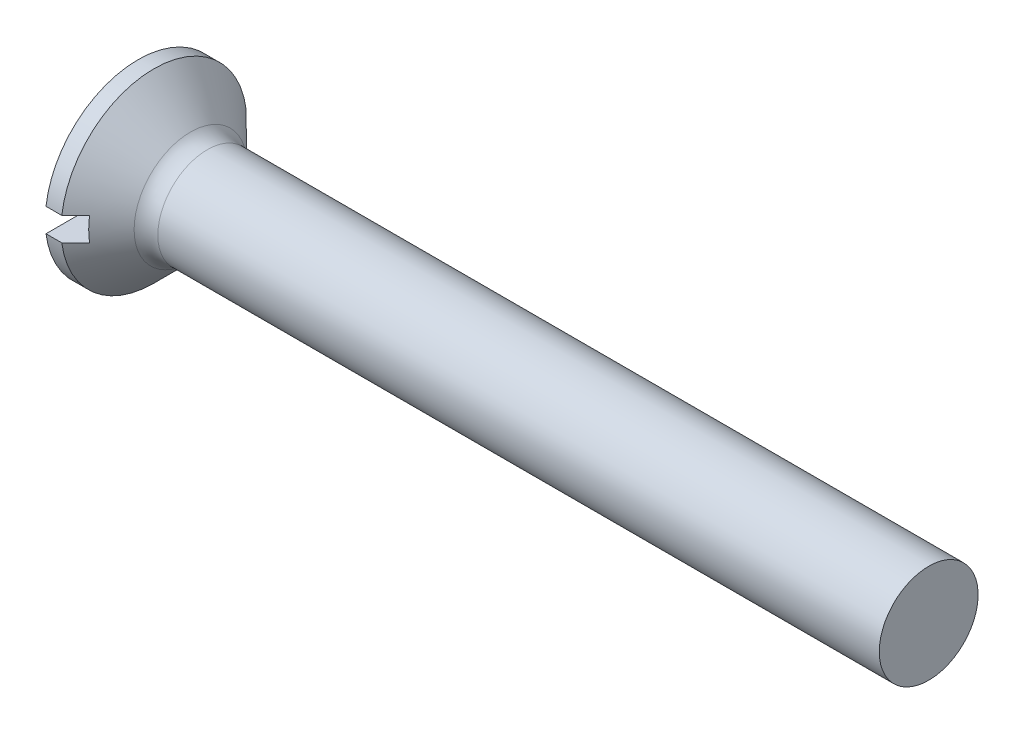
ISO-10303-21;
HEADER;
FILE_DESCRIPTION(('STEP AP214'),'2;1');
FILE_NAME('part.step','',(''),(''),'','','');
FILE_SCHEMA(('AUTOMOTIVE_DESIGN { 1 0 10303 214 1 1 1 1 }'));
ENDSEC;
DATA;
#1=APPLICATION_CONTEXT('core data for automotive mechanical design processes');
#2=APPLICATION_PROTOCOL_DEFINITION('international standard','automotive_design',2000,#1);
#3=PRODUCT_CONTEXT('',#1,'mechanical');
#4=PRODUCT('Part','Part','',(#3));
#5=PRODUCT_RELATED_PRODUCT_CATEGORY('part','',(#4));
#6=PRODUCT_DEFINITION_FORMATION('','',#4);
#7=PRODUCT_DEFINITION_CONTEXT('part definition',#1,'design');
#8=PRODUCT_DEFINITION('design','',#6,#7);
#9=PRODUCT_DEFINITION_SHAPE('','',#8);
#10=(LENGTH_UNIT() NAMED_UNIT(*) SI_UNIT(.MILLI.,.METRE.));
#11=(NAMED_UNIT(*) PLANE_ANGLE_UNIT() SI_UNIT($,.RADIAN.));
#12=(NAMED_UNIT(*) SI_UNIT($,.STERADIAN.) SOLID_ANGLE_UNIT());
#13=UNCERTAINTY_MEASURE_WITH_UNIT(LENGTH_MEASURE(1.E-05),#10,'distance_accuracy_value','');
#14=(GEOMETRIC_REPRESENTATION_CONTEXT(3) GLOBAL_UNCERTAINTY_ASSIGNED_CONTEXT((#13)) GLOBAL_UNIT_ASSIGNED_CONTEXT((#10,
#11,#12)) REPRESENTATION_CONTEXT('',''));
#15=CARTESIAN_POINT('',(0.,0.,0.));
#16=DIRECTION('',(0.,0.,1.));
#17=DIRECTION('',(1.,0.,0.));
#18=AXIS2_PLACEMENT_3D('',#15,#16,#17);
#19=CARTESIAN_POINT('',(0.,0.,0.));
#20=DIRECTION('',(-1.,0.,0.));
#21=DIRECTION('',(0.,0.,0.999999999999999));
#22=AXIS2_PLACEMENT_3D('',#19,#20,#21);
#23=PLANE('',#22);
#24=DIRECTION('',(0.,0.,-0.999999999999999));
#25=VECTOR('',#24,1.);
#26=CARTESIAN_POINT('',(0.,0.300000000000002,2.35));
#27=LINE('',#26,#25);
#28=CARTESIAN_POINT('',(0.,0.299999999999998,2.33077240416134));
#29=VERTEX_POINT('',#28);
#30=CARTESIAN_POINT('',(0.,0.300000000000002,-2.33077240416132));
#31=VERTEX_POINT('',#30);
#32=EDGE_CURVE('E169',#29,#31,#27,.T.);
#33=ORIENTED_EDGE('',*,*,#32,.F.);
#34=CARTESIAN_POINT('',(0.,0.,0.));
#35=DIRECTION('',(-1.,0.,0.));
#36=DIRECTION('',(0.,0.,0.999999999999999));
#37=AXIS2_PLACEMENT_3D('',#34,#35,#36);
#38=CIRCLE('',#37,2.35);
#39=EDGE_CURVE('E111',#29,#31,#38,.T.);
#40=ORIENTED_EDGE('',*,*,#39,.T.);
#41=EDGE_LOOP('',(#33,#40));
#42=FACE_BOUND('',#41,.T.);
#43=ADVANCED_FACE('F30',(#42),#23,.T.);
#44=CARTESIAN_POINT('',(-6.34999999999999,0.,0.));
#45=DIRECTION('',(-1.,0.,0.));
#46=DIRECTION('',(0.,0.,0.999999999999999));
#47=AXIS2_PLACEMENT_3D('',#44,#45,#46);
#48=CYLINDRICAL_SURFACE('',#47,2.35);
#49=DIRECTION('',(-1.,0.,0.));
#50=VECTOR('',#49,1.);
#51=CARTESIAN_POINT('',(-6.34999999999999,0.300000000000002,-2.33077240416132));
#52=LINE('',#51,#50);
#53=CARTESIAN_POINT('',(0.399999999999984,0.300000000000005,-2.33077240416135));
#54=VERTEX_POINT('',#53);
#55=EDGE_CURVE('E58',#31,#54,#52,.F.);
#56=ORIENTED_EDGE('',*,*,#55,.F.);
#57=ORIENTED_EDGE('',*,*,#39,.F.);
#58=DIRECTION('',(-1.,0.,0.));
#59=VECTOR('',#58,1.);
#60=CARTESIAN_POINT('',(-6.34999999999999,0.299999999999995,2.33077240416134));
#61=LINE('',#60,#59);
#62=CARTESIAN_POINT('',(0.400000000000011,0.299999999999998,2.33077240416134));
#63=VERTEX_POINT('',#62);
#64=EDGE_CURVE('E175',#63,#29,#61,.T.);
#65=ORIENTED_EDGE('',*,*,#64,.F.);
#66=CARTESIAN_POINT('',(0.400000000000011,0.,0.));
#67=DIRECTION('',(-1.,0.,0.));
#68=DIRECTION('',(0.,0.,0.999999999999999));
#69=AXIS2_PLACEMENT_3D('',#66,#67,#68);
#70=CIRCLE('',#69,2.35);
#71=EDGE_CURVE('E105',#63,#54,#70,.T.);
#72=ORIENTED_EDGE('',*,*,#71,.T.);
#73=EDGE_LOOP('',(#56,#57,#65,#72));
#74=FACE_BOUND('',#73,.T.);
#75=ADVANCED_FACE('F154',(#74),#48,.T.);
#76=DIRECTION('',(0.,0.,0.999999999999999));
#77=VECTOR('',#76,1.);
#78=CARTESIAN_POINT('',(0.,-0.300000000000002,-2.34999999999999));
#79=LINE('',#78,#77);
#80=CARTESIAN_POINT('',(0.,-0.300000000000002,-2.33077240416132));
#81=VERTEX_POINT('',#80);
#82=CARTESIAN_POINT('',(0.,-0.300000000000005,2.33077240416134));
#83=VERTEX_POINT('',#82);
#84=EDGE_CURVE('E99',#81,#83,#79,.T.);
#85=ORIENTED_EDGE('',*,*,#84,.F.);
#86=EDGE_CURVE('E107',#81,#83,#38,.T.);
#87=ORIENTED_EDGE('',*,*,#86,.T.);
#88=EDGE_LOOP('',(#85,#87));
#89=FACE_BOUND('',#88,.T.);
#90=ADVANCED_FACE('F32',(#89),#23,.T.);
#91=DIRECTION('',(-1.,0.,0.));
#92=VECTOR('',#91,1.);
#93=CARTESIAN_POINT('',(-6.34999999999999,-0.300000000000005,2.33077240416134));
#94=LINE('',#93,#92);
#95=CARTESIAN_POINT('',(0.399999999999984,-0.300000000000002,2.33077240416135));
#96=VERTEX_POINT('',#95);
#97=EDGE_CURVE('E174',#83,#96,#94,.F.);
#98=ORIENTED_EDGE('',*,*,#97,.F.);
#99=ORIENTED_EDGE('',*,*,#86,.F.);
#100=DIRECTION('',(-1.,0.,0.));
#101=VECTOR('',#100,1.);
#102=CARTESIAN_POINT('',(-6.34999999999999,-0.300000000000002,-2.33077240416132));
#103=LINE('',#102,#101);
#104=CARTESIAN_POINT('',(0.400000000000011,-0.300000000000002,-2.33077240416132));
#105=VERTEX_POINT('',#104);
#106=EDGE_CURVE('E172',#105,#81,#103,.T.);
#107=ORIENTED_EDGE('',*,*,#106,.F.);
#108=EDGE_CURVE('E108',#105,#96,#70,.T.);
#109=ORIENTED_EDGE('',*,*,#108,.T.);
#110=EDGE_LOOP('',(#98,#99,#107,#109));
#111=FACE_BOUND('',#110,.T.);
#112=ADVANCED_FACE('F151',(#111),#48,.T.);
#113=CARTESIAN_POINT('',(0.400000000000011,0.,0.));
#114=DIRECTION('',(-1.,0.,0.));
#115=DIRECTION('',(0.,0.,0.999999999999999));
#116=AXIS2_PLACEMENT_3D('',#113,#114,#115);
#117=CONICAL_SURFACE('',#116,2.35,0.78539816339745);
#118=CARTESIAN_POINT('',(-2.4280083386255,0.299999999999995,-5.16931043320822));
#119=CARTESIAN_POINT('',(-2.25261841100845,0.299999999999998,-4.99362307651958));
#120=CARTESIAN_POINT('',(-2.07724133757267,0.299999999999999,-4.81792287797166));
#121=CARTESIAN_POINT('',(-1.72652707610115,0.3,-4.46647837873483));
#122=CARTESIAN_POINT('',(-1.55118988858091,0.3,-4.29073407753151));
#123=CARTESIAN_POINT('',(-1.20052586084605,0.3,-3.93913911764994));
#124=CARTESIAN_POINT('',(-1.02519903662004,0.3,-3.76328844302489));
#125=CARTESIAN_POINT('',(-0.674635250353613,0.3,-3.41150171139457));
#126=CARTESIAN_POINT('',(-0.499398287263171,0.3,-3.235565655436));
#127=CARTESIAN_POINT('',(-0.142742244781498,0.3,-2.87719891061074));
#128=CARTESIAN_POINT('',(0.0386716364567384,0.3,-2.69476304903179));
#129=CARTESIAN_POINT('',(0.401243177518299,0.3,-2.3296236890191));
#130=CARTESIAN_POINT('',(0.582400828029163,0.3,-2.14692018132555));
#131=CARTESIAN_POINT('',(0.853701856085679,0.3,-1.8724663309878));
#132=CARTESIAN_POINT('',(0.944055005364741,0.3,-1.78092337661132));
#133=CARTESIAN_POINT('',(1.1245406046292,0.3,-1.59761714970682));
#134=CARTESIAN_POINT('',(1.21467305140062,0.300000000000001,-1.50585387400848));
#135=CARTESIAN_POINT('',(1.39455527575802,0.3,-1.32196522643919));
#136=CARTESIAN_POINT('',(1.48430507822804,0.3,-1.229839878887));
#137=CARTESIAN_POINT('',(1.66312457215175,0.300000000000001,-1.04493203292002));
#138=CARTESIAN_POINT('',(1.75219428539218,0.300000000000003,-0.952149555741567));
#139=CARTESIAN_POINT('',(1.86420471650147,0.300000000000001,-0.833484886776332));
#140=CARTESIAN_POINT('',(1.88787598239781,0.300000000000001,-0.808293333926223));
#141=CARTESIAN_POINT('',(1.93506265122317,0.3,-0.757763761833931));
#142=CARTESIAN_POINT('',(1.95857805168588,0.3,-0.732425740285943));
#143=CARTESIAN_POINT('',(2.00531964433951,0.300000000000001,-0.681650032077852));
#144=CARTESIAN_POINT('',(2.02854656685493,0.300000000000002,-0.656213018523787));
#145=CARTESIAN_POINT('',(2.07471756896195,0.299999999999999,-0.605084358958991));
#146=CARTESIAN_POINT('',(2.09766165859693,0.299999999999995,-0.579392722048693));
#147=CARTESIAN_POINT('',(2.15086468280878,0.299999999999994,-0.518880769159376));
#148=CARTESIAN_POINT('',(2.18096450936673,0.300000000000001,-0.483920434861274));
#149=CARTESIAN_POINT('',(2.2401471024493,0.3,-0.412740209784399));
#150=CARTESIAN_POINT('',(2.26922201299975,0.299999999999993,-0.376513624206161));
#151=CARTESIAN_POINT('',(2.31115781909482,0.299999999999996,-0.320521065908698));
#152=CARTESIAN_POINT('',(2.3249411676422,0.299999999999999,-0.301451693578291));
#153=CARTESIAN_POINT('',(2.35155128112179,0.300000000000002,-0.262609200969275));
#154=CARTESIAN_POINT('',(2.36437673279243,0.300000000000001,-0.242835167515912));
#155=CARTESIAN_POINT('',(2.38838369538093,0.3,-0.202548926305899));
#156=CARTESIAN_POINT('',(2.39957972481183,0.300000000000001,-0.18204556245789));
#157=CARTESIAN_POINT('',(2.41950326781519,0.3,-0.13989849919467));
#158=CARTESIAN_POINT('',(2.42823853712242,0.299999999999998,-0.118258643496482));
#159=CARTESIAN_POINT('',(2.44121464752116,0.299999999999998,-0.0756315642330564));
#160=CARTESIAN_POINT('',(2.44577820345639,0.299999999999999,-0.0547490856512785));
#161=CARTESIAN_POINT('',(2.45045814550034,0.300000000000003,-0.0125607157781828));
#162=CARTESIAN_POINT('',(2.45059819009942,0.300000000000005,0.00874231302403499));
#163=CARTESIAN_POINT('',(2.44645713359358,0.300000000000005,0.0507745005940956));
#164=CARTESIAN_POINT('',(2.44219645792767,0.300000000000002,0.0715058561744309));
#165=CARTESIAN_POINT('',(2.43034285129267,0.3,0.112088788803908));
#166=CARTESIAN_POINT('',(2.42272600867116,0.300000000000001,0.131932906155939));
#167=CARTESIAN_POINT('',(2.40627133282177,0.300000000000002,0.16848039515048));
#168=CARTESIAN_POINT('',(2.39765896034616,0.300000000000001,0.185289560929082));
#169=CARTESIAN_POINT('',(2.3792568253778,0.3,0.218258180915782));
#170=CARTESIAN_POINT('',(2.36946608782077,0.300000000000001,0.234417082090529));
#171=CARTESIAN_POINT('',(2.33884369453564,0.300000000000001,0.282238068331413));
#172=CARTESIAN_POINT('',(2.3168212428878,0.300000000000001,0.313127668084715));
#173=CARTESIAN_POINT('',(2.27098335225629,0.300000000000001,0.373967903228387));
#174=CARTESIAN_POINT('',(2.24715273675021,0.300000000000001,0.403906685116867));
#175=CARTESIAN_POINT('',(2.19860686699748,0.300000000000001,0.462939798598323));
#176=CARTESIAN_POINT('',(2.17389378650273,0.300000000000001,0.492035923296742));
#177=CARTESIAN_POINT('',(2.09996652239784,0.300000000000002,0.577366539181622));
#178=CARTESIAN_POINT('',(2.04995461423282,0.300000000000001,0.632904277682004));
#179=CARTESIAN_POINT('',(1.94893899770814,0.300000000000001,0.743075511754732));
#180=CARTESIAN_POINT('',(1.89793511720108,0.300000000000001,0.797708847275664));
#181=CARTESIAN_POINT('',(1.79530712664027,0.300000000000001,0.906513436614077));
#182=CARTESIAN_POINT('',(1.74368234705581,0.300000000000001,0.96068405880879));
#183=CARTESIAN_POINT('',(1.64009874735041,0.300000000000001,1.0686957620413));
#184=CARTESIAN_POINT('',(1.58813995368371,0.300000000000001,1.12253686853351));
#185=CARTESIAN_POINT('',(1.4329977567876,0.300000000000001,1.28265340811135));
#186=CARTESIAN_POINT('',(1.3294988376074,0.300000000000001,1.38862292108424));
#187=CARTESIAN_POINT('',(1.12213953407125,0.300000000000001,1.6001073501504));
#188=CARTESIAN_POINT('',(1.0182793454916,0.300000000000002,1.70562245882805));
#189=CARTESIAN_POINT('',(0.776938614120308,0.300000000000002,1.95025555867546));
#190=CARTESIAN_POINT('',(0.639369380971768,0.300000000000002,2.08928605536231));
#191=CARTESIAN_POINT('',(0.364008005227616,0.300000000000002,2.36712673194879));
#192=CARTESIAN_POINT('',(0.226215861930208,0.300000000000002,2.50593691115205));
#193=CARTESIAN_POINT('',(-0.187415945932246,0.300000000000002,2.92222808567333));
#194=CARTESIAN_POINT('',(-0.463453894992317,0.300000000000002,3.19951203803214));
#195=CARTESIAN_POINT('',(-1.02086601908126,0.300000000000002,3.75898808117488));
#196=CARTESIAN_POINT('',(-1.30224437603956,0.300000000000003,4.04117600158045));
#197=CARTESIAN_POINT('',(-1.86507745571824,0.300000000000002,4.60535323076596));
#198=CARTESIAN_POINT('',(-2.14653214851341,0.300000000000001,4.88734256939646));
#199=CARTESIAN_POINT('',(-2.42800833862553,0.299999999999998,5.16931043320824));
#200=B_SPLINE_CURVE_WITH_KNOTS('',3,(#118,#119,#120,#121,#122,#123,#124,#125,#126,#127,#128,
#129,#130,#131,#132,#133,#134,#135,#136,#137,#138,#139,#140,#141,#142,#143,#144,#145,#146,#147,
#148,#149,#150,#151,#152,#153,#154,#155,#156,#157,#158,#159,#160,#161,#162,#163,#164,#165,#166,
#167,#168,#169,#170,#171,#172,#173,#174,#175,#176,#177,#178,#179,#180,#181,#182,#183,#184,#185,
#186,#187,#188,#189,#190,#191,#192,#193,#194,#195,#196,#197,#198,#199),.UNSPECIFIED.,.F.,.F.,(4,
2,2,2,2,2,2,2,2,2,2,2,2,2,2,2,2,2,2,2,2,2,2,2,2,2,2,2,2,2,2,2,2,2,2,2,2,2,2,2,4),(0.,
0.744747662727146,1.48950445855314,2.23446524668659,2.97941712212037,3.75126198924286,
4.5231342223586,4.90900225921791,5.29487588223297,5.68072401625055,6.06655973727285,
6.17026308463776,6.27396806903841,6.37730491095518,6.48063807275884,6.61902727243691,
6.75831338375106,6.82888195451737,6.89954556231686,6.96953490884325,7.03930113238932,
7.10304879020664,7.16645544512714,7.22956912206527,7.29313992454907,7.34974016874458,
7.4063875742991,7.52007317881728,7.63484962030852,7.74936057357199,7.97354071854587,
8.19776012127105,8.42224800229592,8.64671831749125,9.09109579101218,9.53526148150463,
10.1220256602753,10.7087916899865,11.8825672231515,13.078073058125,14.2733188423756),.UNSPECIFIED.);
#201=CARTESIAN_POINT('',(0.750000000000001,0.299999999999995,1.97737199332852));
#202=VERTEX_POINT('',#201);
#203=EDGE_CURVE('E11',#202,#63,#200,.T.);
#204=ORIENTED_EDGE('',*,*,#203,.F.);
#205=CARTESIAN_POINT('',(0.750000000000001,0.,0.));
#206=DIRECTION('',(1.,0.,0.));
#207=DIRECTION('',(0.,0.,-0.999999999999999));
#208=AXIS2_PLACEMENT_3D('',#205,#206,#207);
#209=CIRCLE('',#208,2.);
#210=CARTESIAN_POINT('',(0.750000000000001,-0.300000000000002,1.97737199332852));
#211=VERTEX_POINT('',#210);
#212=EDGE_CURVE('E87',#211,#202,#209,.F.);
#213=ORIENTED_EDGE('',*,*,#212,.F.);
#214=CARTESIAN_POINT('',(-2.42800833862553,-0.300000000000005,5.16931043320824));
#215=CARTESIAN_POINT('',(-2.25261841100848,-0.300000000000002,4.99362307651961));
#216=CARTESIAN_POINT('',(-2.0772413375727,-0.3,4.81792287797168));
#217=CARTESIAN_POINT('',(-1.72652707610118,-0.299999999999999,4.46647837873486));
#218=CARTESIAN_POINT('',(-1.55118988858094,-0.3,4.29073407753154));
#219=CARTESIAN_POINT('',(-1.20052586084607,-0.3,3.93913911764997));
#220=CARTESIAN_POINT('',(-1.02519903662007,-0.3,3.76328844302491));
#221=CARTESIAN_POINT('',(-0.674635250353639,-0.3,3.4115017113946));
#222=CARTESIAN_POINT('',(-0.499398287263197,-0.3,3.23556565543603));
#223=CARTESIAN_POINT('',(-0.142742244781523,-0.3,2.87719891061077));
#224=CARTESIAN_POINT('',(0.038671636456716,-0.300000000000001,2.69476304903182));
#225=CARTESIAN_POINT('',(0.401243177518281,-0.300000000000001,2.32962368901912));
#226=CARTESIAN_POINT('',(0.582400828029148,-0.300000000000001,2.14692018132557));
#227=CARTESIAN_POINT('',(0.853701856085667,-0.300000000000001,1.87246633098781));
#228=CARTESIAN_POINT('',(0.94405500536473,-0.300000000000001,1.78092337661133));
#229=CARTESIAN_POINT('',(1.12454060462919,-0.300000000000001,1.59761714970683));
#230=CARTESIAN_POINT('',(1.21467305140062,-0.300000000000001,1.50585387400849));
#231=CARTESIAN_POINT('',(1.39455527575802,-0.300000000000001,1.32196522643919));
#232=CARTESIAN_POINT('',(1.48430507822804,-0.300000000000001,1.229839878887));
#233=CARTESIAN_POINT('',(1.66312457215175,-0.300000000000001,1.04493203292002));
#234=CARTESIAN_POINT('',(1.75219428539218,-0.300000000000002,0.952149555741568));
#235=CARTESIAN_POINT('',(1.86420471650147,-0.300000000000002,0.833484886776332));
#236=CARTESIAN_POINT('',(1.88787598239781,-0.300000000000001,0.808293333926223));
#237=CARTESIAN_POINT('',(1.93506265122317,-0.300000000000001,0.757763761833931));
#238=CARTESIAN_POINT('',(1.95857805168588,-0.300000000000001,0.732425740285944));
#239=CARTESIAN_POINT('',(2.00531964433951,-0.300000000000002,0.681650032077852));
#240=CARTESIAN_POINT('',(2.02854656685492,-0.300000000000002,0.656213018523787));
#241=CARTESIAN_POINT('',(2.07471756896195,-0.3,0.605084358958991));
#242=CARTESIAN_POINT('',(2.09766165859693,-0.299999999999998,0.579392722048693));
#243=CARTESIAN_POINT('',(2.15086468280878,-0.299999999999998,0.518880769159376));
#244=CARTESIAN_POINT('',(2.18096450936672,-0.300000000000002,0.483920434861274));
#245=CARTESIAN_POINT('',(2.2401471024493,-0.300000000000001,0.412740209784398));
#246=CARTESIAN_POINT('',(2.26922201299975,-0.299999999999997,0.376513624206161));
#247=CARTESIAN_POINT('',(2.31115781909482,-0.299999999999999,0.320521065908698));
#248=CARTESIAN_POINT('',(2.32494116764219,-0.300000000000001,0.301451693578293));
#249=CARTESIAN_POINT('',(2.35155128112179,-0.300000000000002,0.262609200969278));
#250=CARTESIAN_POINT('',(2.36437673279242,-0.300000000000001,0.242835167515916));
#251=CARTESIAN_POINT('',(2.38838369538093,-0.300000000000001,0.202548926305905));
#252=CARTESIAN_POINT('',(2.39957972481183,-0.300000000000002,0.182045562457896));
#253=CARTESIAN_POINT('',(2.41950326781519,-0.300000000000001,0.139898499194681));
#254=CARTESIAN_POINT('',(2.42823853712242,-0.299999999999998,0.118258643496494));
#255=CARTESIAN_POINT('',(2.44121464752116,-0.299999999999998,0.0756315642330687));
#256=CARTESIAN_POINT('',(2.44577820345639,-0.3,0.0547490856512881));
#257=CARTESIAN_POINT('',(2.45045814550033,-0.300000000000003,0.0125607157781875));
#258=CARTESIAN_POINT('',(2.45059819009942,-0.300000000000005,-0.00874231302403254));
#259=CARTESIAN_POINT('',(2.44645713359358,-0.300000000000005,-0.050774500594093));
#260=CARTESIAN_POINT('',(2.44219645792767,-0.300000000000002,-0.0715058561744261));
#261=CARTESIAN_POINT('',(2.43034285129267,-0.300000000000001,-0.112088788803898));
#262=CARTESIAN_POINT('',(2.42272600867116,-0.300000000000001,-0.131932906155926));
#263=CARTESIAN_POINT('',(2.40627133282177,-0.300000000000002,-0.168480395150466));
#264=CARTESIAN_POINT('',(2.39765896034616,-0.300000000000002,-0.18528956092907));
#265=CARTESIAN_POINT('',(2.37925682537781,-0.300000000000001,-0.218258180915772));
#266=CARTESIAN_POINT('',(2.36946608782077,-0.300000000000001,-0.234417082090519));
#267=CARTESIAN_POINT('',(2.33884369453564,-0.300000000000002,-0.282238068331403));
#268=CARTESIAN_POINT('',(2.31682124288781,-0.300000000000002,-0.313127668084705));
#269=CARTESIAN_POINT('',(2.27098335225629,-0.300000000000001,-0.373967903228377));
#270=CARTESIAN_POINT('',(2.24715273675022,-0.300000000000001,-0.403906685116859));
#271=CARTESIAN_POINT('',(2.19860686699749,-0.300000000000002,-0.462939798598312));
#272=CARTESIAN_POINT('',(2.17389378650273,-0.300000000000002,-0.492035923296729));
#273=CARTESIAN_POINT('',(2.09996652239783,-0.300000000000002,-0.577366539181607));
#274=CARTESIAN_POINT('',(2.04995461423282,-0.300000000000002,-0.632904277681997));
#275=CARTESIAN_POINT('',(1.94893899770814,-0.300000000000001,-0.743075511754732));
#276=CARTESIAN_POINT('',(1.89793511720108,-0.300000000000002,-0.797708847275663));
#277=CARTESIAN_POINT('',(1.79530712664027,-0.300000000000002,-0.906513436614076));
#278=CARTESIAN_POINT('',(1.74368234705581,-0.300000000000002,-0.96068405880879));
#279=CARTESIAN_POINT('',(1.6400987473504,-0.300000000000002,-1.0686957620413));
#280=CARTESIAN_POINT('',(1.58813995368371,-0.300000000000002,-1.12253686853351));
#281=CARTESIAN_POINT('',(1.4329977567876,-0.300000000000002,-1.28265340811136));
#282=CARTESIAN_POINT('',(1.32949883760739,-0.300000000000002,-1.38862292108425));
#283=CARTESIAN_POINT('',(1.12213953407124,-0.300000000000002,-1.60010735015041));
#284=CARTESIAN_POINT('',(1.01827934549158,-0.300000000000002,-1.70562245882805));
#285=CARTESIAN_POINT('',(0.776938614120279,-0.300000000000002,-1.95025555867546));
#286=CARTESIAN_POINT('',(0.639369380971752,-0.300000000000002,-2.08928605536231));
#287=CARTESIAN_POINT('',(0.364008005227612,-0.300000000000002,-2.3671267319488));
#288=CARTESIAN_POINT('',(0.226215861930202,-0.300000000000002,-2.50593691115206));
#289=CARTESIAN_POINT('',(-0.187415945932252,-0.300000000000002,-2.92222808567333));
#290=CARTESIAN_POINT('',(-0.463453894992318,-0.300000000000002,-3.19951203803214));
#291=CARTESIAN_POINT('',(-1.02086601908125,-0.300000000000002,-3.75898808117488));
#292=CARTESIAN_POINT('',(-1.30224437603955,-0.300000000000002,-4.04117600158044));
#293=CARTESIAN_POINT('',(-1.86507745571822,-0.300000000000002,-4.60535323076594));
#294=CARTESIAN_POINT('',(-2.14653214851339,-0.300000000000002,-4.88734256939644));
#295=CARTESIAN_POINT('',(-2.4280083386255,-0.300000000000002,-5.16931043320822));
#296=B_SPLINE_CURVE_WITH_KNOTS('',3,(#214,#215,#216,#217,#218,#219,#220,#221,#222,#223,#224,
#225,#226,#227,#228,#229,#230,#231,#232,#233,#234,#235,#236,#237,#238,#239,#240,#241,#242,#243,
#244,#245,#246,#247,#248,#249,#250,#251,#252,#253,#254,#255,#256,#257,#258,#259,#260,#261,#262,
#263,#264,#265,#266,#267,#268,#269,#270,#271,#272,#273,#274,#275,#276,#277,#278,#279,#280,#281,
#282,#283,#284,#285,#286,#287,#288,#289,#290,#291,#292,#293,#294,#295),.UNSPECIFIED.,.F.,.F.,(4,
2,2,2,2,2,2,2,2,2,2,2,2,2,2,2,2,2,2,2,2,2,2,2,2,2,2,2,2,2,2,2,2,2,2,2,2,2,2,2,4),(0.,
0.744747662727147,1.48950445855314,2.23446524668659,2.97941712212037,3.75126198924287,
4.52313422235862,4.90900225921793,5.294875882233,5.68072401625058,6.06655973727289,
6.17026308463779,6.27396806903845,6.37730491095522,6.48063807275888,6.61902727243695,
6.7583133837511,6.8288819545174,6.89954556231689,6.96953490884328,7.03930113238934,
7.10304879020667,7.16645544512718,7.2295691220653,7.2931399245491,7.34974016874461,
7.40638757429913,7.52007317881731,7.63484962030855,7.74936057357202,7.9735407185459,
8.19776012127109,8.42224800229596,8.64671831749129,9.09109579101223,9.53526148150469,
10.1220256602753,10.7087916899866,11.8825672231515,13.078073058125,14.2733188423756),.UNSPECIFIED.);
#297=EDGE_CURVE('E44',#96,#211,#296,.T.);
#298=ORIENTED_EDGE('',*,*,#297,.F.);
#299=ORIENTED_EDGE('',*,*,#108,.F.);
#300=CARTESIAN_POINT('',(0.750000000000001,-0.299999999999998,-1.97737199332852));
#301=VERTEX_POINT('',#300);
#302=EDGE_CURVE('E123',#301,#105,#296,.T.);
#303=ORIENTED_EDGE('',*,*,#302,.F.);
#304=CARTESIAN_POINT('',(0.750000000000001,0.299999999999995,-1.97737199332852));
#305=VERTEX_POINT('',#304);
#306=EDGE_CURVE('E95',#305,#301,#209,.F.);
#307=ORIENTED_EDGE('',*,*,#306,.F.);
#308=EDGE_CURVE('E34',#54,#305,#200,.T.);
#309=ORIENTED_EDGE('',*,*,#308,.F.);
#310=ORIENTED_EDGE('',*,*,#71,.F.);
#311=EDGE_LOOP('',(#204,#213,#298,#299,#303,#307,#309,#310));
#312=FACE_BOUND('',#311,.T.);
#313=CARTESIAN_POINT('',(1.32426406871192,0.,0.));
#314=DIRECTION('',(-1.,0.,0.));
#315=DIRECTION('',(0.,0.,0.999999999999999));
#316=AXIS2_PLACEMENT_3D('',#313,#314,#315);
#317=CIRCLE('',#316,1.42573593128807);
#318=CARTESIAN_POINT('',(1.32426406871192,0.,1.42573593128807));
#319=VERTEX_POINT('',#318);
#320=EDGE_CURVE('E118',#319,#319,#317,.T.);
#321=ORIENTED_EDGE('',*,*,#320,.T.);
#322=EDGE_LOOP('',(#321));
#323=FACE_BOUND('',#322,.T.);
#324=ADVANCED_FACE('F102',(#312,#323),#117,.T.);
#325=CARTESIAN_POINT('',(-6.34999999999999,0.,0.));
#326=DIRECTION('',(-1.,0.,0.));
#327=DIRECTION('',(0.,0.,0.999999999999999));
#328=AXIS2_PLACEMENT_3D('',#325,#326,#327);
#329=CYLINDRICAL_SURFACE('',#328,1.25);
#330=CARTESIAN_POINT('',(1.74852813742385,0.,0.));
#331=DIRECTION('',(-1.,0.,0.));
#332=DIRECTION('',(0.,0.,0.999999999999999));
#333=AXIS2_PLACEMENT_3D('',#330,#331,#332);
#334=CIRCLE('',#333,1.25);
#335=CARTESIAN_POINT('',(1.74852813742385,0.,1.25));
#336=VERTEX_POINT('',#335);
#337=EDGE_CURVE('E121',#336,#336,#334,.F.);
#338=ORIENTED_EDGE('',*,*,#337,.T.);
#339=EDGE_LOOP('',(#338));
#340=FACE_BOUND('',#339,.T.);
#341=CARTESIAN_POINT('',(20.,0.,0.));
#342=DIRECTION('',(-1.,0.,0.));
#343=DIRECTION('',(0.,0.,0.999999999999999));
#344=AXIS2_PLACEMENT_3D('',#341,#342,#343);
#345=CIRCLE('',#344,1.25);
#346=CARTESIAN_POINT('',(20.,0.,1.25));
#347=VERTEX_POINT('',#346);
#348=EDGE_CURVE('E114',#347,#347,#345,.T.);
#349=ORIENTED_EDGE('',*,*,#348,.T.);
#350=EDGE_LOOP('',(#349));
#351=FACE_BOUND('',#350,.T.);
#352=ADVANCED_FACE('F144',(#340,#351),#329,.T.);
#353=CARTESIAN_POINT('',(20.,1.25,0.));
#354=DIRECTION('',(1.,0.,0.));
#355=DIRECTION('',(0.,0.,-0.999999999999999));
#356=AXIS2_PLACEMENT_3D('',#353,#354,#355);
#357=PLANE('',#356);
#358=ORIENTED_EDGE('',*,*,#348,.F.);
#359=EDGE_LOOP('',(#358));
#360=FACE_BOUND('',#359,.T.);
#361=ADVANCED_FACE('F141',(#360),#357,.T.);
#362=CARTESIAN_POINT('',(1.74852813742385,0.,0.));
#363=DIRECTION('',(-1.,0.,0.));
#364=DIRECTION('',(0.,0.,0.999999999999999));
#365=AXIS2_PLACEMENT_3D('',#362,#363,#364);
#366=TOROIDAL_SURFACE('',#365,1.85,0.6);
#367=ORIENTED_EDGE('',*,*,#337,.F.);
#368=EDGE_LOOP('',(#367));
#369=FACE_BOUND('',#368,.T.);
#370=ORIENTED_EDGE('',*,*,#320,.F.);
#371=EDGE_LOOP('',(#370));
#372=FACE_BOUND('',#371,.T.);
#373=ADVANCED_FACE('F138',(#369,#372),#366,.F.);
#374=CARTESIAN_POINT('',(0.750000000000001,0.300000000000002,2.35));
#375=DIRECTION('',(0.,0.999999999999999,0.));
#376=DIRECTION('',(0.,0.,0.999999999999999));
#377=AXIS2_PLACEMENT_3D('',#374,#375,#376);
#378=PLANE('',#377);
#379=ORIENTED_EDGE('',*,*,#55,.T.);
#380=ORIENTED_EDGE('',*,*,#308,.T.);
#381=DIRECTION('',(0.,0.,-0.999999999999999));
#382=VECTOR('',#381,1.);
#383=CARTESIAN_POINT('',(0.750000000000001,0.300000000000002,2.35));
#384=LINE('',#383,#382);
#385=EDGE_CURVE('E51',#202,#305,#384,.T.);
#386=ORIENTED_EDGE('',*,*,#385,.F.);
#387=ORIENTED_EDGE('',*,*,#203,.T.);
#388=ORIENTED_EDGE('',*,*,#64,.T.);
#389=ORIENTED_EDGE('',*,*,#32,.T.);
#390=EDGE_LOOP('',(#379,#380,#386,#387,#388,#389));
#391=FACE_BOUND('',#390,.T.);
#392=ADVANCED_FACE('F96',(#391),#378,.F.);
#393=CARTESIAN_POINT('',(0.750000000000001,-0.300000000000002,-2.34999999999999));
#394=DIRECTION('',(0.,-0.999999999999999,0.));
#395=DIRECTION('',(0.,0.,-0.999999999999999));
#396=AXIS2_PLACEMENT_3D('',#393,#394,#395);
#397=PLANE('',#396);
#398=ORIENTED_EDGE('',*,*,#97,.T.);
#399=ORIENTED_EDGE('',*,*,#297,.T.);
#400=DIRECTION('',(0.,0.,0.999999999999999));
#401=VECTOR('',#400,1.);
#402=CARTESIAN_POINT('',(0.750000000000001,-0.300000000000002,-2.34999999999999));
#403=LINE('',#402,#401);
#404=EDGE_CURVE('E90',#301,#211,#403,.T.);
#405=ORIENTED_EDGE('',*,*,#404,.F.);
#406=ORIENTED_EDGE('',*,*,#302,.T.);
#407=ORIENTED_EDGE('',*,*,#106,.T.);
#408=ORIENTED_EDGE('',*,*,#84,.T.);
#409=EDGE_LOOP('',(#398,#399,#405,#406,#407,#408));
#410=FACE_BOUND('',#409,.T.);
#411=ADVANCED_FACE('F130',(#410),#397,.F.);
#412=CARTESIAN_POINT('',(0.750000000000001,-0.300000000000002,-2.34999999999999));
#413=DIRECTION('',(1.,0.,0.));
#414=DIRECTION('',(0.,0.,-0.999999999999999));
#415=AXIS2_PLACEMENT_3D('',#412,#413,#414);
#416=PLANE('',#415);
#417=ORIENTED_EDGE('',*,*,#212,.T.);
#418=ORIENTED_EDGE('',*,*,#385,.T.);
#419=ORIENTED_EDGE('',*,*,#306,.T.);
#420=ORIENTED_EDGE('',*,*,#404,.T.);
#421=EDGE_LOOP('',(#417,#418,#419,#420));
#422=FACE_BOUND('',#421,.T.);
#423=ADVANCED_FACE('F88',(#422),#416,.F.);
#424=CLOSED_SHELL('',(#43,#75,#90,#112,#324,#352,#361,#373,#392,#411,#423));
#425=MANIFOLD_SOLID_BREP('B2',#424);
#426=ADVANCED_BREP_SHAPE_REPRESENTATION('',(#18,#425),#14);
#427=SHAPE_DEFINITION_REPRESENTATION(#9,#426);
ENDSEC;
END-ISO-10303-21;
